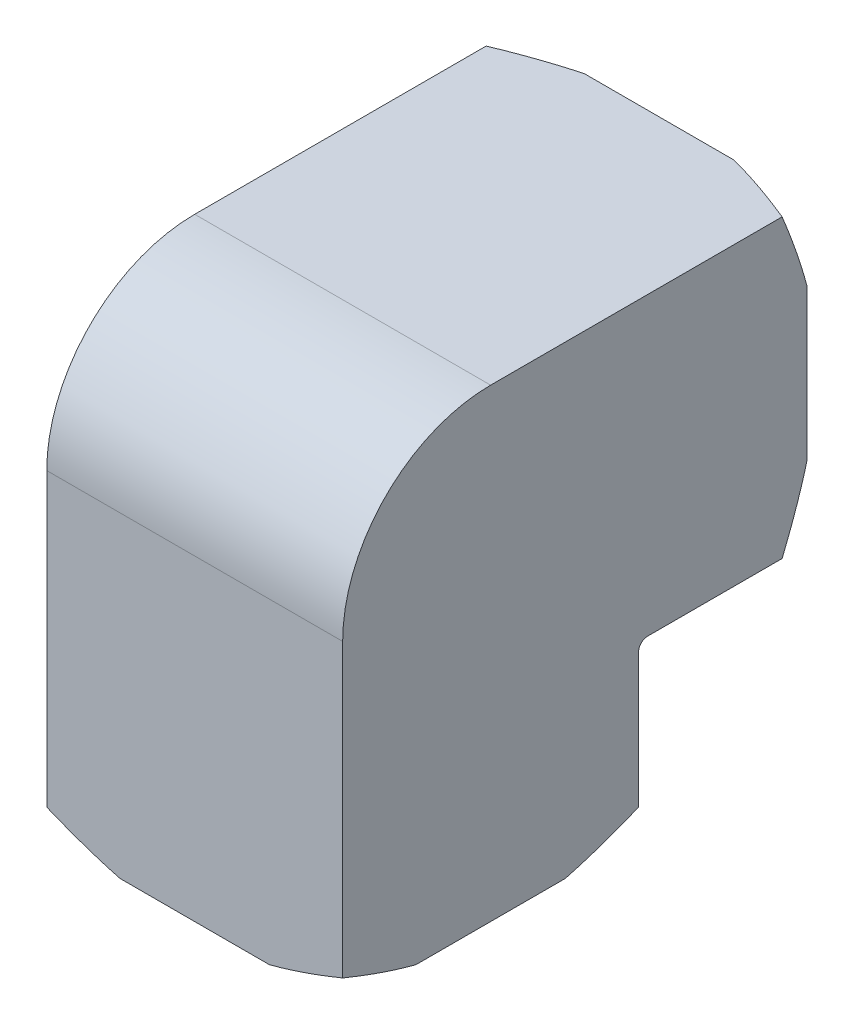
ISO-10303-21;
HEADER;
FILE_DESCRIPTION(('STEP AP214'),'2;1');
FILE_NAME('part.step','',(''),(''),'','','');
FILE_SCHEMA(('AUTOMOTIVE_DESIGN { 1 0 10303 214 1 1 1 1 }'));
ENDSEC;
DATA;
#1=APPLICATION_CONTEXT('core data for automotive mechanical design processes');
#2=APPLICATION_PROTOCOL_DEFINITION('international standard','automotive_design',2000,#1);
#3=PRODUCT_CONTEXT('',#1,'mechanical');
#4=PRODUCT('Part','Part','',(#3));
#5=PRODUCT_RELATED_PRODUCT_CATEGORY('part','',(#4));
#6=PRODUCT_DEFINITION_FORMATION('','',#4);
#7=PRODUCT_DEFINITION_CONTEXT('part definition',#1,'design');
#8=PRODUCT_DEFINITION('design','',#6,#7);
#9=PRODUCT_DEFINITION_SHAPE('','',#8);
#10=(LENGTH_UNIT() NAMED_UNIT(*) SI_UNIT(.MILLI.,.METRE.));
#11=(NAMED_UNIT(*) PLANE_ANGLE_UNIT() SI_UNIT($,.RADIAN.));
#12=(NAMED_UNIT(*) SI_UNIT($,.STERADIAN.) SOLID_ANGLE_UNIT());
#13=UNCERTAINTY_MEASURE_WITH_UNIT(LENGTH_MEASURE(1.E-05),#10,'distance_accuracy_value','');
#14=(GEOMETRIC_REPRESENTATION_CONTEXT(3) GLOBAL_UNCERTAINTY_ASSIGNED_CONTEXT((#13)) GLOBAL_UNIT_ASSIGNED_CONTEXT((#10,
#11,#12)) REPRESENTATION_CONTEXT('',''));
#15=CARTESIAN_POINT('',(0.,0.,0.));
#16=DIRECTION('',(0.,0.,1.));
#17=DIRECTION('',(1.,0.,0.));
#18=AXIS2_PLACEMENT_3D('',#15,#16,#17);
#19=CARTESIAN_POINT('',(0.,1.70527979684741E-10,0.));
#20=DIRECTION('',(0.,-1.,0.));
#21=DIRECTION('',(0.,0.,-1.));
#22=AXIS2_PLACEMENT_3D('',#19,#20,#21);
#23=CONICAL_SURFACE('',#22,8.92936999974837,1.082104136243);
#24=CARTESIAN_POINT('',(0.,0.,0.));
#25=DIRECTION('',(0.,1.,0.));
#26=DIRECTION('',(-1.,0.,0.));
#27=AXIS2_PLACEMENT_3D('',#24,#25,#26);
#28=CIRCLE('',#27,8.92937);
#29=CARTESIAN_POINT('',(8.92937000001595,9.88798645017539E-12,9.88815761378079E-12));
#30=VERTEX_POINT('',#29);
#31=CARTESIAN_POINT('',(-8.92937000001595,9.88806917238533E-12,9.88789800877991E-12));
#32=VERTEX_POINT('',#31);
#33=EDGE_CURVE('E139',#30,#32,#28,.F.);
#34=ORIENTED_EDGE('',*,*,#33,.T.);
#35=CARTESIAN_POINT('',(-8.92937000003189,1.97755915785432E-11,1.97763427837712E-11));
#36=CARTESIAN_POINT('',(-8.74389852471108,0.0986048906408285,0.0986048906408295));
#37=CARTESIAN_POINT('',(-8.55784954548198,0.196671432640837,0.196671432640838));
#38=CARTESIAN_POINT('',(-8.18437014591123,0.39150124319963,0.39150124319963));
#39=CARTESIAN_POINT('',(-7.99693961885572,0.488264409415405,0.488264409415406));
#40=CARTESIAN_POINT('',(-7.62007081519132,0.680464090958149,0.68046409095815));
#41=CARTESIAN_POINT('',(-7.43062893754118,0.77589708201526,0.775897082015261));
#42=CARTESIAN_POINT('',(-7.04989543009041,0.964895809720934,0.964895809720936));
#43=CARTESIAN_POINT('',(-6.85860384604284,1.05846159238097,1.05846159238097));
#44=CARTESIAN_POINT('',(-6.46788902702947,1.24619785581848,1.24619785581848));
#45=CARTESIAN_POINT('',(-6.26839740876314,1.34029735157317,1.34029735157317));
#46=CARTESIAN_POINT('',(-5.86668607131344,1.5255360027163,1.5255360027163));
#47=CARTESIAN_POINT('',(-5.66446645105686,1.61667526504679,1.61667526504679));
#48=CARTESIAN_POINT('',(-5.2569519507,1.7951924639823,1.7951924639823));
#49=CARTESIAN_POINT('',(-5.05165974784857,1.88257344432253,1.88257344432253));
#50=CARTESIAN_POINT('',(-4.63726797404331,2.05267906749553,2.05267906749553));
#51=CARTESIAN_POINT('',(-4.42816890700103,2.1354043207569,2.1354043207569));
#52=CARTESIAN_POINT('',(-4.00906605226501,2.29357155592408,2.29357155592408));
#53=CARTESIAN_POINT('',(-3.7991382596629,2.36911354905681,2.36911354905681));
#54=CARTESIAN_POINT('',(-3.37424111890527,2.51287732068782,2.51287732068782));
#55=CARTESIAN_POINT('',(-3.15927101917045,2.58109799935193,2.58109799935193));
#56=CARTESIAN_POINT('',(-2.72507287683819,2.70775423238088,2.70775423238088));
#57=CARTESIAN_POINT('',(-2.50587773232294,2.76624553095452,2.76624553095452));
#58=CARTESIAN_POINT('',(-2.06185362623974,2.8714115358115,2.8714115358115));
#59=CARTESIAN_POINT('',(-1.83702647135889,2.91808997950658,2.91808997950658));
#60=CARTESIAN_POINT('',(-1.42680752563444,2.98916472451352,2.98916472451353));
#61=CARTESIAN_POINT('',(-1.24231386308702,3.01613434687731,3.01613434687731));
#62=CARTESIAN_POINT('',(-0.870813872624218,3.05932672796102,3.05932672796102));
#63=CARTESIAN_POINT('',(-0.683807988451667,3.07555135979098,3.07555135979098));
#64=CARTESIAN_POINT('',(-0.308983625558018,3.09629483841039,3.09629483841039));
#65=CARTESIAN_POINT('',(-0.121168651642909,3.10084483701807,3.10084483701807));
#66=CARTESIAN_POINT('',(0.254289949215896,3.09804665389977,3.09804665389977));
#67=CARTESIAN_POINT('',(0.441933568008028,3.09069793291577,3.09069793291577));
#68=CARTESIAN_POINT('',(0.814167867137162,3.06465329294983,3.06465329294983));
#69=CARTESIAN_POINT('',(0.998770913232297,3.04604413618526,3.04604413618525));
#70=CARTESIAN_POINT('',(1.36529728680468,2.99857211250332,2.99857211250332));
#71=CARTESIAN_POINT('',(1.54722035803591,2.96970827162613,2.96970827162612));
#72=CARTESIAN_POINT('',(1.90966595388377,2.90270209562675,2.90270209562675));
#73=CARTESIAN_POINT('',(2.09015237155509,2.86446330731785,2.86446330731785));
#74=CARTESIAN_POINT('',(2.44742472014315,2.78031607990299,2.78031607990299));
#75=CARTESIAN_POINT('',(2.62421142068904,2.73440925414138,2.73440925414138));
#76=CARTESIAN_POINT('',(3.08789762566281,2.60437374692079,2.60437374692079));
#77=CARTESIAN_POINT('',(3.37172770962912,2.51478759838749,2.51478759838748));
#78=CARTESIAN_POINT('',(3.93094211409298,2.32317976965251,2.32317976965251));
#79=CARTESIAN_POINT('',(4.20631972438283,2.2211485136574,2.2211485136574));
#80=CARTESIAN_POINT('',(4.7510944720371,2.00768180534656,2.00768180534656));
#81=CARTESIAN_POINT('',(5.02046264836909,1.89620970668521,1.89620970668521));
#82=CARTESIAN_POINT('',(5.55336035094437,1.66666454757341,1.66666454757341));
#83=CARTESIAN_POINT('',(5.81689154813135,1.54859341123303,1.54859341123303));
#84=CARTESIAN_POINT('',(6.32315597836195,1.31495309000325,1.31495309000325));
#85=CARTESIAN_POINT('',(6.5661660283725,1.19968228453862,1.19968228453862));
#86=CARTESIAN_POINT('',(7.04890273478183,0.965729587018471,0.96572958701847));
#87=CARTESIAN_POINT('',(7.28862908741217,0.847047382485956,0.847047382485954));
#88=CARTESIAN_POINT('',(7.76311861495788,0.608141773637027,0.608141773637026));
#89=CARTESIAN_POINT('',(7.99790729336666,0.487943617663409,0.487943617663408));
#90=CARTESIAN_POINT('',(8.46521641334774,0.245437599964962,0.245437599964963));
#91=CARTESIAN_POINT('',(8.69773735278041,0.123130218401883,0.123130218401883));
#92=CARTESIAN_POINT('',(8.92937000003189,1.97764250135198E-11,1.97756738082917E-11));
#93=B_SPLINE_CURVE_WITH_KNOTS('',3,(#35,#36,#37,#38,#39,#40,#41,#42,#43,#44,#45,#46,#47,#48,#49,
#50,#51,#52,#53,#54,#55,#56,#57,#58,#59,#60,#61,#62,#63,#64,#65,#66,#67,#68,#69,#70,#71,#72,#73,
#74,#75,#76,#77,#78,#79,#80,#81,#82,#83,#84,#85,#86,#87,#88,#89,#90,#91,#92),.UNSPECIFIED.,.F.,
.F.,(4,2,2,2,2,2,2,2,2,2,2,2,2,2,2,2,2,2,2,2,2,2,2,2,2,2,2,2,4),(0.,0.696143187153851,
1.39234072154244,2.09012420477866,2.78789047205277,3.50726249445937,4.22660849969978,
4.94536051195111,5.66401806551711,6.37044184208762,7.07697159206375,7.77930237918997,
8.48141068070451,9.04604285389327,9.61057657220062,10.1736023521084,10.7366536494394,
11.2954208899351,11.8542412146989,12.4190717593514,12.9837836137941,13.915323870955,
14.8475854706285,15.7836480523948,16.7194391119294,17.5972392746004,18.475120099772,
19.3446851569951,20.2140548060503),.UNSPECIFIED.);
#94=EDGE_CURVE('E20',#32,#30,#93,.T.);
#95=ORIENTED_EDGE('',*,*,#94,.T.);
#96=EDGE_LOOP('',(#34,#95));
#97=FACE_BOUND('',#96,.T.);
#98=ADVANCED_FACE('F16',(#97),#23,.F.);
#99=CARTESIAN_POINT('',(0.,0.,1.70527979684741E-10));
#100=DIRECTION('',(0.,0.,-1.));
#101=DIRECTION('',(0.,1.,0.));
#102=AXIS2_PLACEMENT_3D('',#99,#100,#101);
#103=CONICAL_SURFACE('',#102,8.92936999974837,1.082104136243);
#104=CARTESIAN_POINT('',(0.,0.,0.));
#105=DIRECTION('',(0.,0.,1.));
#106=DIRECTION('',(1.,0.,0.));
#107=AXIS2_PLACEMENT_3D('',#104,#105,#106);
#108=CIRCLE('',#107,8.92937);
#109=EDGE_CURVE('E144',#32,#30,#108,.F.);
#110=ORIENTED_EDGE('',*,*,#109,.T.);
#111=ORIENTED_EDGE('',*,*,#94,.F.);
#112=EDGE_LOOP('',(#110,#111));
#113=FACE_BOUND('',#112,.T.);
#114=ADVANCED_FACE('F149',(#113),#103,.F.);
#115=CARTESIAN_POINT('',(0.,-17.926685,0.));
#116=DIRECTION('',(0.,1.,0.));
#117=DIRECTION('',(-1.,0.,0.));
#118=AXIS2_PLACEMENT_3D('',#115,#116,#117);
#119=CYLINDRICAL_SURFACE('',#118,8.92937);
#120=CARTESIAN_POINT('',(0.,-20.6801253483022,0.));
#121=DIRECTION('',(0.,-1.,0.));
#122=DIRECTION('',(0.,0.,-1.));
#123=AXIS2_PLACEMENT_3D('',#120,#121,#122);
#124=CIRCLE('',#123,8.92937000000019);
#125=CARTESIAN_POINT('',(0.,-20.6801253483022,-8.92937000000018));
#126=VERTEX_POINT('',#125);
#127=EDGE_CURVE('E148',#126,#126,#124,.T.);
#128=ORIENTED_EDGE('',*,*,#127,.T.);
#129=EDGE_LOOP('',(#128));
#130=FACE_BOUND('',#129,.T.);
#131=ORIENTED_EDGE('',*,*,#33,.F.);
#132=CARTESIAN_POINT('',(0.,0.,0.));
#133=DIRECTION('',(0.,0.707106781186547,-0.707106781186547));
#134=DIRECTION('',(0.,0.707106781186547,0.707106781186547));
#135=AXIS2_PLACEMENT_3D('',#132,#133,#134);
#136=ELLIPSE('',#135,12.6280361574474,8.92937);
#137=EDGE_CURVE('E142',#30,#32,#136,.T.);
#138=ORIENTED_EDGE('',*,*,#137,.T.);
#139=EDGE_LOOP('',(#131,#138));
#140=FACE_BOUND('',#139,.T.);
#141=ADVANCED_FACE('F140',(#130,#140),#119,.F.);
#142=CARTESIAN_POINT('',(0.,0.,-17.926685));
#143=DIRECTION('',(0.,0.,1.));
#144=DIRECTION('',(1.,0.,0.));
#145=AXIS2_PLACEMENT_3D('',#142,#143,#144);
#146=CYLINDRICAL_SURFACE('',#145,8.92937);
#147=CARTESIAN_POINT('',(0.,0.,-20.6801253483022));
#148=DIRECTION('',(0.,0.,-1.));
#149=DIRECTION('',(0.,-1.,0.));
#150=AXIS2_PLACEMENT_3D('',#147,#148,#149);
#151=CIRCLE('',#150,8.92937000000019);
#152=CARTESIAN_POINT('',(0.,-8.92937000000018,-20.6801253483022));
#153=VERTEX_POINT('',#152);
#154=EDGE_CURVE('E234',#153,#153,#151,.T.);
#155=ORIENTED_EDGE('',*,*,#154,.T.);
#156=EDGE_LOOP('',(#155));
#157=FACE_BOUND('',#156,.T.);
#158=ORIENTED_EDGE('',*,*,#109,.F.);
#159=ORIENTED_EDGE('',*,*,#137,.F.);
#160=EDGE_LOOP('',(#158,#159));
#161=FACE_BOUND('',#160,.T.);
#162=ADVANCED_FACE('F147',(#157,#161),#146,.F.);
#163=CARTESIAN_POINT('',(0.,-25.3307004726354,0.));
#164=DIRECTION('',(0.,-1.,0.));
#165=DIRECTION('',(0.,0.,-1.));
#166=AXIS2_PLACEMENT_3D('',#163,#164,#165);
#167=CONICAL_SURFACE('',#166,9.07470047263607,0.0312398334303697);
#168=ORIENTED_EDGE('',*,*,#127,.F.);
#169=EDGE_LOOP('',(#168));
#170=FACE_BOUND('',#169,.T.);
#171=CARTESIAN_POINT('',(0.,-25.3307004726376,0.));
#172=DIRECTION('',(0.,-1.,0.));
#173=DIRECTION('',(0.,0.,-1.));
#174=AXIS2_PLACEMENT_3D('',#171,#172,#173);
#175=CIRCLE('',#174,9.07470047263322);
#176=CARTESIAN_POINT('',(0.,-25.3307004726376,-9.07470047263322));
#177=VERTEX_POINT('',#176);
#178=EDGE_CURVE('E226',#177,#177,#175,.T.);
#179=ORIENTED_EDGE('',*,*,#178,.T.);
#180=EDGE_LOOP('',(#179));
#181=FACE_BOUND('',#180,.T.);
#182=ADVANCED_FACE('F250',(#170,#181),#167,.F.);
#183=CARTESIAN_POINT('',(0.,0.,-25.3307004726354));
#184=DIRECTION('',(0.,0.,-1.));
#185=DIRECTION('',(0.,1.,0.));
#186=AXIS2_PLACEMENT_3D('',#183,#184,#185);
#187=CONICAL_SURFACE('',#186,9.07470047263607,0.0312398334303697);
#188=ORIENTED_EDGE('',*,*,#154,.F.);
#189=EDGE_LOOP('',(#188));
#190=FACE_BOUND('',#189,.T.);
#191=CARTESIAN_POINT('',(0.,0.,-25.3307004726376));
#192=DIRECTION('',(0.,0.,-1.));
#193=DIRECTION('',(0.,-1.,0.));
#194=AXIS2_PLACEMENT_3D('',#191,#192,#193);
#195=CIRCLE('',#194,9.07470047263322);
#196=CARTESIAN_POINT('',(0.,-9.07470047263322,-25.3307004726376));
#197=VERTEX_POINT('',#196);
#198=EDGE_CURVE('E220',#197,#197,#195,.T.);
#199=ORIENTED_EDGE('',*,*,#198,.T.);
#200=EDGE_LOOP('',(#199));
#201=FACE_BOUND('',#200,.T.);
#202=ADVANCED_FACE('F252',(#190,#201),#187,.F.);
#203=CARTESIAN_POINT('',(0.,-27.1779999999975,0.));
#204=DIRECTION('',(0.,-1.,0.));
#205=DIRECTION('',(0.,0.,-1.));
#206=AXIS2_PLACEMENT_3D('',#203,#204,#205);
#207=CONICAL_SURFACE('',#206,10.9220000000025,0.785398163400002);
#208=CARTESIAN_POINT('',(0.,-27.1779999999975,0.));
#209=DIRECTION('',(0.,-1.,0.));
#210=DIRECTION('',(0.,0.,-1.));
#211=AXIS2_PLACEMENT_3D('',#208,#209,#210);
#212=CIRCLE('',#211,10.9220000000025);
#213=CARTESIAN_POINT('',(0.,-27.1779999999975,-10.9220000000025));
#214=VERTEX_POINT('',#213);
#215=EDGE_CURVE('E344',#214,#214,#212,.T.);
#216=ORIENTED_EDGE('',*,*,#215,.T.);
#217=EDGE_LOOP('',(#216));
#218=FACE_BOUND('',#217,.T.);
#219=ORIENTED_EDGE('',*,*,#178,.F.);
#220=EDGE_LOOP('',(#219));
#221=FACE_BOUND('',#220,.T.);
#222=ADVANCED_FACE('F259',(#218,#221),#207,.F.);
#223=CARTESIAN_POINT('',(0.,-25.0077800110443,0.));
#224=DIRECTION('',(0.,1.,0.));
#225=DIRECTION('',(-1.,0.,0.));
#226=AXIS2_PLACEMENT_3D('',#223,#224,#225);
#227=CONICAL_SURFACE('',#226,17.9829312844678,1.0471975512);
#228=CARTESIAN_POINT('',(0.,-27.177999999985,0.));
#229=DIRECTION('',(0.,1.,0.));
#230=DIRECTION('',(-1.,0.,0.));
#231=AXIS2_PLACEMENT_3D('',#228,#229,#230);
#232=CIRCLE('',#231,14.2239999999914);
#233=CARTESIAN_POINT('',(12.7,-27.1779999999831,-6.40563626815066));
#234=VERTEX_POINT('',#233);
#235=CARTESIAN_POINT('',(6.40563626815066,-27.1779999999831,-12.7));
#236=VERTEX_POINT('',#235);
#237=EDGE_CURVE('E339',#234,#236,#232,.T.);
#238=ORIENTED_EDGE('',*,*,#237,.T.);
#239=CARTESIAN_POINT('',(12.6999999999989,-25.0207236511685,-12.7));
#240=CARTESIAN_POINT('',(12.4430541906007,-25.125615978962,-12.7));
#241=CARTESIAN_POINT('',(12.185555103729,-25.2291539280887,-12.7));
#242=CARTESIAN_POINT('',(11.6693430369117,-25.4331872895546,-12.7));
#243=CARTESIAN_POINT('',(11.4106300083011,-25.533682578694,-12.7));
#244=CARTESIAN_POINT('',(10.6331224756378,-25.8298693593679,-12.7));
#245=CARTESIAN_POINT('',(10.112383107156,-26.0204987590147,-12.7));
#246=CARTESIAN_POINT('',(9.06478171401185,-26.3849455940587,-12.7));
#247=CARTESIAN_POINT('',(8.53791751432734,-26.5587568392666,-12.7));
#248=CARTESIAN_POINT('',(7.7424558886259,-26.8037032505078,-12.7));
#249=CARTESIAN_POINT('',(7.47629387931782,-26.8827626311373,-12.7));
#250=CARTESIAN_POINT('',(6.94225691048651,-27.0349716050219,-12.7));
#251=CARTESIAN_POINT('',(6.67438177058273,-27.1081205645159,-12.7));
#252=CARTESIAN_POINT('',(6.40563626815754,-27.1779999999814,-12.7));
#253=B_SPLINE_CURVE_WITH_KNOTS('',3,(#239,#240,#241,#242,#243,#244,#245,#246,#247,#248,#249,
#250,#251,#252),.UNSPECIFIED.,.F.,.F.,(4,2,2,2,2,2,4),(0.,0.832588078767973,1.66520982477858,
3.32858413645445,4.99256836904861,5.82547367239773,6.65846816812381),.UNSPECIFIED.);
#254=CARTESIAN_POINT('',(12.7,-25.0207236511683,-12.6999999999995));
#255=VERTEX_POINT('',#254);
#256=EDGE_CURVE('E335',#255,#236,#253,.T.);
#257=ORIENTED_EDGE('',*,*,#256,.F.);
#258=CARTESIAN_POINT('',(12.7,-25.0207236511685,-12.6999999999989));
#259=CARTESIAN_POINT('',(12.7,-25.125615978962,-12.4430541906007));
#260=CARTESIAN_POINT('',(12.7,-25.2291539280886,-12.185555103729));
#261=CARTESIAN_POINT('',(12.7,-25.4331872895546,-11.6693430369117));
#262=CARTESIAN_POINT('',(12.7,-25.533682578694,-11.4106300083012));
#263=CARTESIAN_POINT('',(12.7,-25.8298693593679,-10.6331224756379));
#264=CARTESIAN_POINT('',(12.7,-26.0204987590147,-10.1123831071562));
#265=CARTESIAN_POINT('',(12.7,-26.3849455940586,-9.06478171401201));
#266=CARTESIAN_POINT('',(12.7,-26.5587568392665,-8.53791751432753));
#267=CARTESIAN_POINT('',(12.7,-26.8037032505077,-7.74245588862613));
#268=CARTESIAN_POINT('',(12.7,-26.8827626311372,-7.47629387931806));
#269=CARTESIAN_POINT('',(12.7,-27.0349716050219,-6.94225691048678));
#270=CARTESIAN_POINT('',(12.7,-27.1081205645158,-6.674381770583));
#271=CARTESIAN_POINT('',(12.7,-27.1779999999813,-6.40563626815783));
#272=B_SPLINE_CURVE_WITH_KNOTS('',3,(#258,#259,#260,#261,#262,#263,#264,#265,#266,#267,#268,
#269,#270,#271),.UNSPECIFIED.,.F.,.F.,(4,2,2,2,2,2,4),(0.,0.832588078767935,1.6652098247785,
3.3285841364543,4.99256836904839,5.82547367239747,6.65846816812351),.UNSPECIFIED.);
#273=EDGE_CURVE('E347',#255,#234,#272,.T.);
#274=ORIENTED_EDGE('',*,*,#273,.T.);
#275=EDGE_LOOP('',(#238,#257,#274));
#276=FACE_BOUND('',#275,.T.);
#277=ADVANCED_FACE('F358',(#276),#227,.T.);
#278=CARTESIAN_POINT('',(0.,-13.4874,-13.4874));
#279=DIRECTION('',(1.,0.,0.));
#280=DIRECTION('',(0.,0.,-1.));
#281=AXIS2_PLACEMENT_3D('',#278,#279,#280);
#282=CYLINDRICAL_SURFACE('',#281,0.787399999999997);
#283=DIRECTION('',(1.,0.,0.));
#284=VECTOR('',#283,1.);
#285=CARTESIAN_POINT('',(0.,-12.7,-13.4874));
#286=LINE('',#285,#284);
#287=CARTESIAN_POINT('',(12.7,-12.7,-13.4874));
#288=VERTEX_POINT('',#287);
#289=CARTESIAN_POINT('',(-12.7,-12.7,-13.4874));
#290=VERTEX_POINT('',#289);
#291=EDGE_CURVE('E324',#288,#290,#286,.F.);
#292=ORIENTED_EDGE('',*,*,#291,.F.);
#293=CARTESIAN_POINT('',(12.7,-13.4874,-13.4874));
#294=DIRECTION('',(1.,0.,0.));
#295=DIRECTION('',(0.,0.,-1.));
#296=AXIS2_PLACEMENT_3D('',#293,#294,#295);
#297=CIRCLE('',#296,0.787399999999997);
#298=CARTESIAN_POINT('',(12.7,-13.4874,-12.7));
#299=VERTEX_POINT('',#298);
#300=EDGE_CURVE('E350',#288,#299,#297,.T.);
#301=ORIENTED_EDGE('',*,*,#300,.T.);
#302=DIRECTION('',(-1.,0.,0.));
#303=VECTOR('',#302,1.);
#304=CARTESIAN_POINT('',(0.,-13.4874,-12.7));
#305=LINE('',#304,#303);
#306=CARTESIAN_POINT('',(-12.7,-13.4874,-12.7));
#307=VERTEX_POINT('',#306);
#308=EDGE_CURVE('E331',#307,#299,#305,.F.);
#309=ORIENTED_EDGE('',*,*,#308,.F.);
#310=CARTESIAN_POINT('',(-12.7,-13.4874,-13.4874));
#311=DIRECTION('',(1.,0.,0.));
#312=DIRECTION('',(0.,0.,-1.));
#313=AXIS2_PLACEMENT_3D('',#310,#311,#312);
#314=CIRCLE('',#313,0.787399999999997);
#315=EDGE_CURVE('E225',#290,#307,#314,.T.);
#316=ORIENTED_EDGE('',*,*,#315,.F.);
#317=EDGE_LOOP('',(#292,#301,#309,#316));
#318=FACE_BOUND('',#317,.T.);
#319=ADVANCED_FACE('F363',(#318),#282,.F.);
#320=CARTESIAN_POINT('',(0.,0.,-25.0077800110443));
#321=DIRECTION('',(0.,0.,1.));
#322=DIRECTION('',(1.,0.,0.));
#323=AXIS2_PLACEMENT_3D('',#320,#321,#322);
#324=CONICAL_SURFACE('',#323,17.9829312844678,1.0471975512);
#325=CARTESIAN_POINT('',(0.,0.,-27.177999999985));
#326=DIRECTION('',(0.,0.,1.));
#327=DIRECTION('',(1.,0.,0.));
#328=AXIS2_PLACEMENT_3D('',#325,#326,#327);
#329=CIRCLE('',#328,14.2239999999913);
#330=CARTESIAN_POINT('',(6.40563626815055,-12.7,-27.1779999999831));
#331=VERTEX_POINT('',#330);
#332=CARTESIAN_POINT('',(12.7,-6.40563626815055,-27.1779999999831));
#333=VERTEX_POINT('',#332);
#334=EDGE_CURVE('E316',#331,#333,#329,.T.);
#335=ORIENTED_EDGE('',*,*,#334,.T.);
#336=CARTESIAN_POINT('',(12.7,-6.40563626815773,-27.1779999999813));
#337=CARTESIAN_POINT('',(12.7,-6.67438177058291,-27.1081205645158));
#338=CARTESIAN_POINT('',(12.7,-6.94225691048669,-27.0349716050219));
#339=CARTESIAN_POINT('',(12.7,-7.47629387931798,-26.8827626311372));
#340=CARTESIAN_POINT('',(12.7,-7.74245588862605,-26.8037032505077));
#341=CARTESIAN_POINT('',(12.7,-8.53791751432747,-26.5587568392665));
#342=CARTESIAN_POINT('',(12.7,-9.06478171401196,-26.3849455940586));
#343=CARTESIAN_POINT('',(12.7,-10.1123831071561,-26.0204987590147));
#344=CARTESIAN_POINT('',(12.7,-10.6331224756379,-25.8298693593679));
#345=CARTESIAN_POINT('',(12.7,-11.4106300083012,-25.533682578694));
#346=CARTESIAN_POINT('',(12.7,-11.6693430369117,-25.4331872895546));
#347=CARTESIAN_POINT('',(12.7,-12.185555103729,-25.2291539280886));
#348=CARTESIAN_POINT('',(12.7,-12.4430541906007,-25.125615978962));
#349=CARTESIAN_POINT('',(12.7,-12.6999999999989,-25.0207236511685));
#350=B_SPLINE_CURVE_WITH_KNOTS('',3,(#336,#337,#338,#339,#340,#341,#342,#343,#344,#345,#346,
#347,#348,#349),.UNSPECIFIED.,.F.,.F.,(4,2,2,2,2,2,4),(0.,0.832994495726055,1.66589979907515,
3.32988403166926,4.99325834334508,5.82588008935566,6.65846816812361),.UNSPECIFIED.);
#351=CARTESIAN_POINT('',(12.6999999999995,-12.6999999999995,-25.0207236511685));
#352=VERTEX_POINT('',#351);
#353=EDGE_CURVE('E412',#333,#352,#350,.T.);
#354=ORIENTED_EDGE('',*,*,#353,.T.);
#355=CARTESIAN_POINT('',(6.4056362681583,-12.7000000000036,-27.1779999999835));
#356=CARTESIAN_POINT('',(6.67438177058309,-12.7000000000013,-27.1081205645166));
#357=CARTESIAN_POINT('',(6.94225691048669,-12.7000000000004,-27.0349716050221));
#358=CARTESIAN_POINT('',(7.47629387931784,-12.6999999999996,-26.882762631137));
#359=CARTESIAN_POINT('',(7.74245588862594,-12.6999999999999,-26.8037032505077));
#360=CARTESIAN_POINT('',(8.53791751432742,-12.7000000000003,-26.5587568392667));
#361=CARTESIAN_POINT('',(9.06478171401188,-12.7000000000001,-26.3849455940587));
#362=CARTESIAN_POINT('',(10.112383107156,-12.6999999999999,-26.0204987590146));
#363=CARTESIAN_POINT('',(10.6331224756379,-12.7,-25.8298693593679));
#364=CARTESIAN_POINT('',(11.4106300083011,-12.7,-25.533682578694));
#365=CARTESIAN_POINT('',(11.6693430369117,-12.7,-25.4331872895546));
#366=CARTESIAN_POINT('',(12.185555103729,-12.7,-25.2291539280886));
#367=CARTESIAN_POINT('',(12.4430541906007,-12.7,-25.125615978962));
#368=CARTESIAN_POINT('',(12.6999999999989,-12.7,-25.0207236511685));
#369=B_SPLINE_CURVE_WITH_KNOTS('',3,(#355,#356,#357,#358,#359,#360,#361,#362,#363,#364,#365,
#366,#367,#368),.UNSPECIFIED.,.F.,.F.,(4,2,2,2,2,2,4),(0.,0.832994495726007,1.66589979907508,
3.3298840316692,4.99325834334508,5.82588008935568,6.65846816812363),.UNSPECIFIED.);
#370=EDGE_CURVE('E325',#331,#352,#369,.T.);
#371=ORIENTED_EDGE('',*,*,#370,.F.);
#372=EDGE_LOOP('',(#335,#354,#371));
#373=FACE_BOUND('',#372,.T.);
#374=ADVANCED_FACE('F419',(#373),#324,.T.);
#375=CARTESIAN_POINT('',(0.,0.,-27.1779999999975));
#376=DIRECTION('',(0.,0.,-1.));
#377=DIRECTION('',(-1.,0.,0.));
#378=AXIS2_PLACEMENT_3D('',#375,#376,#377);
#379=CONICAL_SURFACE('',#378,10.9220000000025,0.785398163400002);
#380=CARTESIAN_POINT('',(0.,0.,-27.1779999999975));
#381=DIRECTION('',(0.,0.,-1.));
#382=DIRECTION('',(-1.,0.,0.));
#383=AXIS2_PLACEMENT_3D('',#380,#381,#382);
#384=CIRCLE('',#383,10.9220000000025);
#385=CARTESIAN_POINT('',(-10.9220000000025,0.,-27.1779999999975));
#386=VERTEX_POINT('',#385);
#387=EDGE_CURVE('E466',#386,#386,#384,.T.);
#388=ORIENTED_EDGE('',*,*,#387,.T.);
#389=EDGE_LOOP('',(#388));
#390=FACE_BOUND('',#389,.T.);
#391=ORIENTED_EDGE('',*,*,#198,.F.);
#392=EDGE_LOOP('',(#391));
#393=FACE_BOUND('',#392,.T.);
#394=ADVANCED_FACE('F422',(#390,#393),#379,.F.);
#395=CARTESIAN_POINT('',(0.,0.,-25.0077800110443));
#396=DIRECTION('',(0.,0.,1.));
#397=DIRECTION('',(1.,0.,0.));
#398=AXIS2_PLACEMENT_3D('',#395,#396,#397);
#399=CONICAL_SURFACE('',#398,17.9829312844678,1.0471975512);
#400=CARTESIAN_POINT('',(0.,0.,-27.177999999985));
#401=DIRECTION('',(0.,0.,1.));
#402=DIRECTION('',(1.,0.,0.));
#403=AXIS2_PLACEMENT_3D('',#400,#401,#402);
#404=CIRCLE('',#403,14.2239999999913);
#405=CARTESIAN_POINT('',(12.7,6.40563626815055,-27.1779999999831));
#406=VERTEX_POINT('',#405);
#407=CARTESIAN_POINT('',(6.40563626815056,12.7,-27.1779999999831));
#408=VERTEX_POINT('',#407);
#409=EDGE_CURVE('E315',#406,#408,#404,.T.);
#410=ORIENTED_EDGE('',*,*,#409,.T.);
#411=CARTESIAN_POINT('',(12.6999999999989,12.7,-25.0207236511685));
#412=CARTESIAN_POINT('',(12.4430541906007,12.7,-25.125615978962));
#413=CARTESIAN_POINT('',(12.185555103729,12.7,-25.2291539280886));
#414=CARTESIAN_POINT('',(11.6693430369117,12.7,-25.4331872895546));
#415=CARTESIAN_POINT('',(11.4106300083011,12.7,-25.533682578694));
#416=CARTESIAN_POINT('',(10.6331224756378,12.7,-25.8298693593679));
#417=CARTESIAN_POINT('',(10.112383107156,12.7,-26.0204987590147));
#418=CARTESIAN_POINT('',(9.06478171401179,12.7,-26.3849455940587));
#419=CARTESIAN_POINT('',(8.53791751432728,12.7,-26.5587568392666));
#420=CARTESIAN_POINT('',(7.74245588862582,12.7,-26.8037032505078));
#421=CARTESIAN_POINT('',(7.47629387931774,12.7,-26.8827626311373));
#422=CARTESIAN_POINT('',(6.94225691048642,12.7,-27.0349716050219));
#423=CARTESIAN_POINT('',(6.67438177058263,12.7,-27.1081205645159));
#424=CARTESIAN_POINT('',(6.40563626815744,12.7,-27.1779999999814));
#425=B_SPLINE_CURVE_WITH_KNOTS('',3,(#411,#412,#413,#414,#415,#416,#417,#418,#419,#420,#421,
#422,#423,#424),.UNSPECIFIED.,.F.,.F.,(4,2,2,2,2,2,4),(0.,0.832588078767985,1.6652098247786,
3.3285841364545,4.99256836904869,5.82547367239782,6.65846816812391),.UNSPECIFIED.);
#426=CARTESIAN_POINT('',(12.7,12.6999999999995,-25.0207236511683));
#427=VERTEX_POINT('',#426);
#428=EDGE_CURVE('E307',#427,#408,#425,.T.);
#429=ORIENTED_EDGE('',*,*,#428,.F.);
#430=CARTESIAN_POINT('',(12.7,12.6999999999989,-25.0207236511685));
#431=CARTESIAN_POINT('',(12.7,12.4430541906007,-25.125615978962));
#432=CARTESIAN_POINT('',(12.7,12.185555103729,-25.2291539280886));
#433=CARTESIAN_POINT('',(12.7,11.6693430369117,-25.4331872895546));
#434=CARTESIAN_POINT('',(12.7,11.4106300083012,-25.533682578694));
#435=CARTESIAN_POINT('',(12.7,10.6331224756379,-25.8298693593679));
#436=CARTESIAN_POINT('',(12.7,10.1123831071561,-26.0204987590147));
#437=CARTESIAN_POINT('',(12.7,9.06478171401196,-26.3849455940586));
#438=CARTESIAN_POINT('',(12.7,8.53791751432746,-26.5587568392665));
#439=CARTESIAN_POINT('',(12.7,7.74245588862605,-26.8037032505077));
#440=CARTESIAN_POINT('',(12.7,7.47629387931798,-26.8827626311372));
#441=CARTESIAN_POINT('',(12.7,6.94225691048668,-27.0349716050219));
#442=CARTESIAN_POINT('',(12.7,6.67438177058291,-27.1081205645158));
#443=CARTESIAN_POINT('',(12.7,6.40563626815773,-27.1779999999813));
#444=B_SPLINE_CURVE_WITH_KNOTS('',3,(#430,#431,#432,#433,#434,#435,#436,#437,#438,#439,#440,
#441,#442,#443),.UNSPECIFIED.,.F.,.F.,(4,2,2,2,2,2,4),(0.,0.832588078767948,1.66520982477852,
3.32858413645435,4.99256836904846,5.82547367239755,6.65846816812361),.UNSPECIFIED.);
#445=EDGE_CURVE('E219',#427,#406,#444,.T.);
#446=ORIENTED_EDGE('',*,*,#445,.T.);
#447=EDGE_LOOP('',(#410,#429,#446));
#448=FACE_BOUND('',#447,.T.);
#449=ADVANCED_FACE('F204',(#448),#399,.T.);
#450=CARTESIAN_POINT('',(0.,-25.0077800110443,0.));
#451=DIRECTION('',(0.,1.,0.));
#452=DIRECTION('',(-1.,0.,0.));
#453=AXIS2_PLACEMENT_3D('',#450,#451,#452);
#454=CONICAL_SURFACE('',#453,17.9829312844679,1.0471975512);
#455=CARTESIAN_POINT('',(0.,-27.177999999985,0.));
#456=DIRECTION('',(0.,1.,0.));
#457=DIRECTION('',(-1.,0.,0.));
#458=AXIS2_PLACEMENT_3D('',#455,#456,#457);
#459=CIRCLE('',#458,14.2239999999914);
#460=CARTESIAN_POINT('',(6.40563626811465,-27.1779999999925,12.7));
#461=VERTEX_POINT('',#460);
#462=CARTESIAN_POINT('',(12.7,-27.1779999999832,6.40563626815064));
#463=VERTEX_POINT('',#462);
#464=EDGE_CURVE('E340',#461,#463,#459,.T.);
#465=ORIENTED_EDGE('',*,*,#464,.T.);
#466=CARTESIAN_POINT('',(12.7,-27.1779999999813,6.4056362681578));
#467=CARTESIAN_POINT('',(12.7,-27.1081205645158,6.67438177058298));
#468=CARTESIAN_POINT('',(12.7,-27.0349716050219,6.94225691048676));
#469=CARTESIAN_POINT('',(12.7,-26.8827626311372,7.47629387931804));
#470=CARTESIAN_POINT('',(12.7,-26.8037032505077,7.74245588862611));
#471=CARTESIAN_POINT('',(12.7,-26.5587568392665,8.53791751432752));
#472=CARTESIAN_POINT('',(12.7,-26.3849455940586,9.064781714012));
#473=CARTESIAN_POINT('',(12.7,-26.0204987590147,10.1123831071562));
#474=CARTESIAN_POINT('',(12.7,-25.8298693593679,10.6331224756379));
#475=CARTESIAN_POINT('',(12.7,-25.533682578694,11.4106300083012));
#476=CARTESIAN_POINT('',(12.7,-25.4331872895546,11.6693430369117));
#477=CARTESIAN_POINT('',(12.7,-25.2291539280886,12.185555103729));
#478=CARTESIAN_POINT('',(12.7,-25.125615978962,12.4430541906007));
#479=CARTESIAN_POINT('',(12.7,-25.0207236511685,12.6999999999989));
#480=B_SPLINE_CURVE_WITH_KNOTS('',3,(#466,#467,#468,#469,#470,#471,#472,#473,#474,#475,#476,
#477,#478,#479),.UNSPECIFIED.,.F.,.F.,(4,2,2,2,2,2,4),(0.,0.832994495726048,1.66589979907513,
3.32988403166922,4.99325834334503,5.82588008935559,6.65846816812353),.UNSPECIFIED.);
#481=CARTESIAN_POINT('',(12.6999999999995,-25.0207236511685,12.6999999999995));
#482=VERTEX_POINT('',#481);
#483=EDGE_CURVE('E212',#463,#482,#480,.T.);
#484=ORIENTED_EDGE('',*,*,#483,.T.);
#485=CARTESIAN_POINT('',(6.40563626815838,-27.1779999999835,12.7000000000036));
#486=CARTESIAN_POINT('',(6.67438177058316,-27.1081205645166,12.7000000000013));
#487=CARTESIAN_POINT('',(6.94225691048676,-27.0349716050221,12.7000000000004));
#488=CARTESIAN_POINT('',(7.47629387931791,-26.882762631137,12.6999999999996));
#489=CARTESIAN_POINT('',(7.74245588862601,-26.8037032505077,12.6999999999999));
#490=CARTESIAN_POINT('',(8.53791751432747,-26.5587568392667,12.7000000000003));
#491=CARTESIAN_POINT('',(9.06478171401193,-26.3849455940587,12.7000000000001));
#492=CARTESIAN_POINT('',(10.1123831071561,-26.0204987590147,12.6999999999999));
#493=CARTESIAN_POINT('',(10.6331224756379,-25.8298693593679,12.7));
#494=CARTESIAN_POINT('',(11.4106300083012,-25.533682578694,12.7));
#495=CARTESIAN_POINT('',(11.6693430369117,-25.4331872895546,12.7));
#496=CARTESIAN_POINT('',(12.185555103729,-25.2291539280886,12.7));
#497=CARTESIAN_POINT('',(12.4430541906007,-25.125615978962,12.7));
#498=CARTESIAN_POINT('',(12.6999999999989,-25.0207236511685,12.7));
#499=B_SPLINE_CURVE_WITH_KNOTS('',3,(#485,#486,#487,#488,#489,#490,#491,#492,#493,#494,#495,
#496,#497,#498),.UNSPECIFIED.,.F.,.F.,(4,2,2,2,2,2,4),(0.,0.832994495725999,1.66589979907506,
3.32988403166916,4.99325834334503,5.82588008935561,6.65846816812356),.UNSPECIFIED.);
#500=EDGE_CURVE('E188',#461,#482,#499,.T.);
#501=ORIENTED_EDGE('',*,*,#500,.F.);
#502=EDGE_LOOP('',(#465,#484,#501));
#503=FACE_BOUND('',#502,.T.);
#504=ADVANCED_FACE('F198',(#503),#454,.T.);
#505=CARTESIAN_POINT('',(12.7,38.1,0.));
#506=DIRECTION('',(-1.,0.,0.));
#507=DIRECTION('',(0.,-1.,0.));
#508=AXIS2_PLACEMENT_3D('',#505,#506,#507);
#509=PLANE('',#508);
#510=DIRECTION('',(0.,1.,0.));
#511=VECTOR('',#510,1.);
#512=CARTESIAN_POINT('',(12.7,-13.4874,-12.7));
#513=LINE('',#512,#511);
#514=EDGE_CURVE('E328',#299,#255,#513,.F.);
#515=ORIENTED_EDGE('',*,*,#514,.F.);
#516=ORIENTED_EDGE('',*,*,#300,.F.);
#517=DIRECTION('',(0.,0.,-1.));
#518=VECTOR('',#517,1.);
#519=CARTESIAN_POINT('',(12.7,-12.7,-27.3812));
#520=LINE('',#519,#518);
#521=EDGE_CURVE('E321',#352,#288,#520,.F.);
#522=ORIENTED_EDGE('',*,*,#521,.F.);
#523=ORIENTED_EDGE('',*,*,#353,.F.);
#524=DIRECTION('',(0.,-1.,0.));
#525=VECTOR('',#524,1.);
#526=CARTESIAN_POINT('',(12.7,-37.211,-27.178));
#527=LINE('',#526,#525);
#528=EDGE_CURVE('E312',#333,#406,#527,.F.);
#529=ORIENTED_EDGE('',*,*,#528,.T.);
#530=ORIENTED_EDGE('',*,*,#445,.F.);
#531=DIRECTION('',(0.,0.,1.));
#532=VECTOR('',#531,1.);
#533=CARTESIAN_POINT('',(12.7,12.7,0.));
#534=LINE('',#533,#532);
#535=CARTESIAN_POINT('',(12.7,12.7,0.));
#536=VERTEX_POINT('',#535);
#537=EDGE_CURVE('E308',#536,#427,#534,.F.);
#538=ORIENTED_EDGE('',*,*,#537,.F.);
#539=CARTESIAN_POINT('',(12.7,0.,0.));
#540=DIRECTION('',(1.,0.,0.));
#541=DIRECTION('',(0.,0.,-1.));
#542=AXIS2_PLACEMENT_3D('',#539,#540,#541);
#543=CIRCLE('',#542,12.7);
#544=CARTESIAN_POINT('',(12.7,0.,12.7));
#545=VERTEX_POINT('',#544);
#546=EDGE_CURVE('E196',#545,#536,#543,.F.);
#547=ORIENTED_EDGE('',*,*,#546,.F.);
#548=DIRECTION('',(0.,-1.,0.));
#549=VECTOR('',#548,1.);
#550=CARTESIAN_POINT('',(12.7,-27.3812,12.7));
#551=LINE('',#550,#549);
#552=EDGE_CURVE('E194',#482,#545,#551,.F.);
#553=ORIENTED_EDGE('',*,*,#552,.F.);
#554=ORIENTED_EDGE('',*,*,#483,.F.);
#555=DIRECTION('',(0.,0.,1.));
#556=VECTOR('',#555,1.);
#557=CARTESIAN_POINT('',(12.7,-27.178,-37.211));
#558=LINE('',#557,#556);
#559=EDGE_CURVE('E337',#463,#234,#558,.F.);
#560=ORIENTED_EDGE('',*,*,#559,.T.);
#561=ORIENTED_EDGE('',*,*,#273,.F.);
#562=EDGE_LOOP('',(#515,#516,#522,#523,#529,#530,#538,#547,#553,#554,#560,#561));
#563=FACE_BOUND('',#562,.T.);
#564=ADVANCED_FACE('F203',(#563),#509,.F.);
#565=CARTESIAN_POINT('',(0.,-27.178,-37.211));
#566=DIRECTION('',(0.,1.,0.));
#567=DIRECTION('',(0.,0.,1.));
#568=AXIS2_PLACEMENT_3D('',#565,#566,#567);
#569=PLANE('',#568);
#570=ORIENTED_EDGE('',*,*,#215,.F.);
#571=EDGE_LOOP('',(#570));
#572=FACE_BOUND('',#571,.T.);
#573=ORIENTED_EDGE('',*,*,#559,.F.);
#574=ORIENTED_EDGE('',*,*,#464,.F.);
#575=DIRECTION('',(1.,0.,0.));
#576=VECTOR('',#575,1.);
#577=CARTESIAN_POINT('',(0.,-27.178,12.7));
#578=LINE('',#577,#576);
#579=CARTESIAN_POINT('',(-6.40563626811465,-27.1779999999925,12.7));
#580=VERTEX_POINT('',#579);
#581=EDGE_CURVE('E187',#580,#461,#578,.T.);
#582=ORIENTED_EDGE('',*,*,#581,.F.);
#583=CARTESIAN_POINT('',(0.,-27.177999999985,0.));
#584=DIRECTION('',(0.,1.,0.));
#585=DIRECTION('',(-1.,0.,0.));
#586=AXIS2_PLACEMENT_3D('',#583,#584,#585);
#587=CIRCLE('',#586,14.2239999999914);
#588=CARTESIAN_POINT('',(-12.7,-27.1779999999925,6.40563626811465));
#589=VERTEX_POINT('',#588);
#590=EDGE_CURVE('E179',#589,#580,#587,.T.);
#591=ORIENTED_EDGE('',*,*,#590,.F.);
#592=DIRECTION('',(0.,0.,1.));
#593=VECTOR('',#592,1.);
#594=CARTESIAN_POINT('',(-12.7,-27.178,0.));
#595=LINE('',#594,#593);
#596=CARTESIAN_POINT('',(-12.7,-27.1779999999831,-6.40563626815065));
#597=VERTEX_POINT('',#596);
#598=EDGE_CURVE('E178',#589,#597,#595,.F.);
#599=ORIENTED_EDGE('',*,*,#598,.T.);
#600=CARTESIAN_POINT('',(0.,-27.177999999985,0.));
#601=DIRECTION('',(0.,1.,0.));
#602=DIRECTION('',(-1.,0.,0.));
#603=AXIS2_PLACEMENT_3D('',#600,#601,#602);
#604=CIRCLE('',#603,14.2239999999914);
#605=CARTESIAN_POINT('',(-6.40563626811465,-27.1779999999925,-12.7));
#606=VERTEX_POINT('',#605);
#607=EDGE_CURVE('E374',#606,#597,#604,.T.);
#608=ORIENTED_EDGE('',*,*,#607,.F.);
#609=DIRECTION('',(-1.,0.,0.));
#610=VECTOR('',#609,1.);
#611=CARTESIAN_POINT('',(0.,-27.178,-12.7));
#612=LINE('',#611,#610);
#613=EDGE_CURVE('E332',#236,#606,#612,.T.);
#614=ORIENTED_EDGE('',*,*,#613,.F.);
#615=ORIENTED_EDGE('',*,*,#237,.F.);
#616=EDGE_LOOP('',(#573,#574,#582,#591,#599,#608,#614,#615));
#617=FACE_BOUND('',#616,.T.);
#618=ADVANCED_FACE('F391',(#572,#617),#569,.F.);
#619=CARTESIAN_POINT('',(0.,-25.0077800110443,0.));
#620=DIRECTION('',(0.,1.,0.));
#621=DIRECTION('',(-1.,0.,0.));
#622=AXIS2_PLACEMENT_3D('',#619,#620,#621);
#623=CONICAL_SURFACE('',#622,17.9829312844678,1.0471975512);
#624=ORIENTED_EDGE('',*,*,#607,.T.);
#625=CARTESIAN_POINT('',(-12.7,-27.1779999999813,-6.40563626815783));
#626=CARTESIAN_POINT('',(-12.7,-27.1081205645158,-6.67438177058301));
#627=CARTESIAN_POINT('',(-12.7,-27.0349716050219,-6.94225691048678));
#628=CARTESIAN_POINT('',(-12.7,-26.8827626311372,-7.47629387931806));
#629=CARTESIAN_POINT('',(-12.7,-26.8037032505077,-7.74245588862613));
#630=CARTESIAN_POINT('',(-12.7,-26.5587568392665,-8.53791751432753));
#631=CARTESIAN_POINT('',(-12.7,-26.3849455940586,-9.06478171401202));
#632=CARTESIAN_POINT('',(-12.7,-26.0204987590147,-10.1123831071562));
#633=CARTESIAN_POINT('',(-12.7,-25.8298693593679,-10.6331224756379));
#634=CARTESIAN_POINT('',(-12.7,-25.533682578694,-11.4106300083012));
#635=CARTESIAN_POINT('',(-12.7,-25.4331872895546,-11.6693430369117));
#636=CARTESIAN_POINT('',(-12.7,-25.2291539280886,-12.185555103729));
#637=CARTESIAN_POINT('',(-12.7,-25.125615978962,-12.4430541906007));
#638=CARTESIAN_POINT('',(-12.7,-25.0207236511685,-12.6999999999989));
#639=B_SPLINE_CURVE_WITH_KNOTS('',3,(#625,#626,#627,#628,#629,#630,#631,#632,#633,#634,#635,
#636,#637,#638),.UNSPECIFIED.,.F.,.F.,(4,2,2,2,2,2,4),(0.,0.83299449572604,1.66589979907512,
3.32988403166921,4.993258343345,5.82588008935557,6.6584681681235),.UNSPECIFIED.);
#640=CARTESIAN_POINT('',(-12.6999999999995,-25.0207236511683,-12.7));
#641=VERTEX_POINT('',#640);
#642=EDGE_CURVE('E180',#597,#641,#639,.T.);
#643=ORIENTED_EDGE('',*,*,#642,.T.);
#644=CARTESIAN_POINT('',(-6.4056362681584,-27.1779999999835,-12.7000000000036));
#645=CARTESIAN_POINT('',(-6.67438177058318,-27.1081205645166,-12.7000000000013));
#646=CARTESIAN_POINT('',(-6.94225691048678,-27.0349716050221,-12.7000000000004));
#647=CARTESIAN_POINT('',(-7.47629387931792,-26.882762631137,-12.6999999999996));
#648=CARTESIAN_POINT('',(-7.74245588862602,-26.8037032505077,-12.6999999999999));
#649=CARTESIAN_POINT('',(-8.53791751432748,-26.5587568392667,-12.7000000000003));
#650=CARTESIAN_POINT('',(-9.06478171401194,-26.3849455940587,-12.7000000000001));
#651=CARTESIAN_POINT('',(-10.1123831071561,-26.0204987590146,-12.6999999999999));
#652=CARTESIAN_POINT('',(-10.6331224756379,-25.8298693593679,-12.7));
#653=CARTESIAN_POINT('',(-11.4106300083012,-25.533682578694,-12.7));
#654=CARTESIAN_POINT('',(-11.6693430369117,-25.4331872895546,-12.7));
#655=CARTESIAN_POINT('',(-12.185555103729,-25.2291539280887,-12.7));
#656=CARTESIAN_POINT('',(-12.4430541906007,-25.125615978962,-12.7));
#657=CARTESIAN_POINT('',(-12.6999999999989,-25.0207236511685,-12.7));
#658=B_SPLINE_CURVE_WITH_KNOTS('',3,(#644,#645,#646,#647,#648,#649,#650,#651,#652,#653,#654,
#655,#656,#657),.UNSPECIFIED.,.F.,.F.,(4,2,2,2,2,2,4),(0.,0.832994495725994,1.66589979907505,
3.32988403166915,4.99325834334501,5.82588008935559,6.65846816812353),.UNSPECIFIED.);
#659=EDGE_CURVE('E334',#606,#641,#658,.T.);
#660=ORIENTED_EDGE('',*,*,#659,.F.);
#661=EDGE_LOOP('',(#624,#643,#660));
#662=FACE_BOUND('',#661,.T.);
#663=ADVANCED_FACE('F384',(#662),#623,.T.);
#664=CARTESIAN_POINT('',(0.,-13.4874,-12.7));
#665=DIRECTION('',(0.,0.,-1.));
#666=DIRECTION('',(-1.,0.,0.));
#667=AXIS2_PLACEMENT_3D('',#664,#665,#666);
#668=PLANE('',#667);
#669=ORIENTED_EDGE('',*,*,#308,.T.);
#670=ORIENTED_EDGE('',*,*,#514,.T.);
#671=ORIENTED_EDGE('',*,*,#256,.T.);
#672=ORIENTED_EDGE('',*,*,#613,.T.);
#673=ORIENTED_EDGE('',*,*,#659,.T.);
#674=DIRECTION('',(0.,1.,0.));
#675=VECTOR('',#674,1.);
#676=CARTESIAN_POINT('',(-12.7,-50.8,-12.7));
#677=LINE('',#676,#675);
#678=EDGE_CURVE('E294',#641,#307,#677,.T.);
#679=ORIENTED_EDGE('',*,*,#678,.T.);
#680=EDGE_LOOP('',(#669,#670,#671,#672,#673,#679));
#681=FACE_BOUND('',#680,.T.);
#682=ADVANCED_FACE('F379',(#681),#668,.T.);
#683=CARTESIAN_POINT('',(0.,-12.7,-27.3812));
#684=DIRECTION('',(0.,-1.,0.));
#685=DIRECTION('',(0.,0.,-1.));
#686=AXIS2_PLACEMENT_3D('',#683,#684,#685);
#687=PLANE('',#686);
#688=ORIENTED_EDGE('',*,*,#291,.T.);
#689=DIRECTION('',(0.,0.,1.));
#690=VECTOR('',#689,1.);
#691=CARTESIAN_POINT('',(-12.7,-12.7,0.));
#692=LINE('',#691,#690);
#693=CARTESIAN_POINT('',(-12.699999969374,-12.6999999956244,-25.0207236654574));
#694=VERTEX_POINT('',#693);
#695=EDGE_CURVE('E291',#290,#694,#692,.F.);
#696=ORIENTED_EDGE('',*,*,#695,.T.);
#697=CARTESIAN_POINT('',(-6.40563626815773,-12.7,-27.1779999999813));
#698=CARTESIAN_POINT('',(-6.674381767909,-12.7,-27.1081205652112));
#699=CARTESIAN_POINT('',(-6.94225690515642,-12.7,-27.0349716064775));
#700=CARTESIAN_POINT('',(-7.47629386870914,-12.7,-26.8827626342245));
#701=CARTESIAN_POINT('',(-7.74245587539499,-12.7,-26.8037032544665));
#702=CARTESIAN_POINT('',(-8.53791749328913,-12.7,-26.5587568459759));
#703=CARTESIAN_POINT('',(-9.06478168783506,-12.7,-26.3849456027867));
#704=CARTESIAN_POINT('',(-10.1123830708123,-12.7,-26.0204987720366));
#705=CARTESIAN_POINT('',(-10.6331224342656,-12.7,-25.8298693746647));
#706=CARTESIAN_POINT('',(-11.4106299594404,-12.7,-25.5336825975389));
#707=CARTESIAN_POINT('',(-11.6693429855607,-12.7,-25.4331873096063));
#708=CARTESIAN_POINT('',(-12.1855550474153,-12.7,-25.2291539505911));
#709=CARTESIAN_POINT('',(-12.4430541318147,-12.7,-25.1256160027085));
#710=CARTESIAN_POINT('',(-12.699999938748,-12.7,-25.0207236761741));
#711=B_SPLINE_CURVE_WITH_KNOTS('',3,(#697,#698,#699,#700,#701,#702,#703,#704,#705,#706,#707,
#708,#709,#710),.UNSPECIFIED.,.F.,.F.,(4,2,2,2,2,2,4),(0.,0.83299448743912,1.66589978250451,
3.32988399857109,4.99325829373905,5.82588003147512,6.65846810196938),.UNSPECIFIED.);
#712=CARTESIAN_POINT('',(-6.40563626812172,-12.7,-27.1779999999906));
#713=VERTEX_POINT('',#712);
#714=EDGE_CURVE('E320',#713,#694,#711,.T.);
#715=ORIENTED_EDGE('',*,*,#714,.F.);
#716=DIRECTION('',(1.,0.,0.));
#717=VECTOR('',#716,1.);
#718=CARTESIAN_POINT('',(0.,-12.7,-27.178));
#719=LINE('',#718,#717);
#720=EDGE_CURVE('E317',#713,#331,#719,.T.);
#721=ORIENTED_EDGE('',*,*,#720,.T.);
#722=ORIENTED_EDGE('',*,*,#370,.T.);
#723=ORIENTED_EDGE('',*,*,#521,.T.);
#724=EDGE_LOOP('',(#688,#696,#715,#721,#722,#723));
#725=FACE_BOUND('',#724,.T.);
#726=ADVANCED_FACE('F383',(#725),#687,.T.);
#727=CARTESIAN_POINT('',(0.,0.,-25.0077800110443));
#728=DIRECTION('',(0.,0.,1.));
#729=DIRECTION('',(1.,0.,0.));
#730=AXIS2_PLACEMENT_3D('',#727,#728,#729);
#731=CONICAL_SURFACE('',#730,17.9829312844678,1.0471975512);
#732=CARTESIAN_POINT('',(-12.6999999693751,-12.6999999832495,-25.0207236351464));
#733=CARTESIAN_POINT('',(-12.6999999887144,-12.4430541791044,-25.1256159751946));
#734=CARTESIAN_POINT('',(-12.6999999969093,-12.1855550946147,-25.2291539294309));
#735=CARTESIAN_POINT('',(-12.7000000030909,-11.6693430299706,-25.4331872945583));
#736=CARTESIAN_POINT('',(-12.7000000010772,-11.4106300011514,-25.5336825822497));
#737=CARTESIAN_POINT('',(-12.699999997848,-10.6331224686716,-25.8298693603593));
#738=CARTESIAN_POINT('',(-12.6999999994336,-10.1123831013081,-26.0204987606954));
#739=CARTESIAN_POINT('',(-12.7000000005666,-9.06478171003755,-26.384945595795));
#740=CARTESIAN_POINT('',(-12.7000000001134,-8.5379175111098,-26.5587568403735));
#741=CARTESIAN_POINT('',(-12.6999999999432,-7.7424558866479,-26.8037032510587));
#742=CARTESIAN_POINT('',(-12.6999999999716,-7.47629387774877,-26.8827626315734));
#743=CARTESIAN_POINT('',(-12.7000000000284,-6.94225690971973,-27.0349716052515));
#744=CARTESIAN_POINT('',(-12.7000000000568,-6.67438177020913,-27.1081205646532));
#745=CARTESIAN_POINT('',(-12.7,-6.40563626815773,-27.1779999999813));
#746=B_SPLINE_CURVE_WITH_KNOTS('',3,(#732,#733,#734,#735,#736,#737,#738,#739,#740,#741,#742,
#743,#744,#745),.UNSPECIFIED.,.F.,.F.,(4,2,2,2,2,2,4),(0.,0.832588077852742,1.66520982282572,
3.32858413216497,4.99256836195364,5.82547366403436,6.65846815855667),.UNSPECIFIED.);
#747=CARTESIAN_POINT('',(-12.7,-6.40563626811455,-27.1779999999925));
#748=VERTEX_POINT('',#747);
#749=EDGE_CURVE('E290',#694,#748,#746,.T.);
#750=ORIENTED_EDGE('',*,*,#749,.T.);
#751=CARTESIAN_POINT('',(0.,0.,-27.177999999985));
#752=DIRECTION('',(0.,0.,1.));
#753=DIRECTION('',(1.,0.,0.));
#754=AXIS2_PLACEMENT_3D('',#751,#752,#753);
#755=CIRCLE('',#754,14.2239999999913);
#756=EDGE_CURVE('E469',#748,#713,#755,.T.);
#757=ORIENTED_EDGE('',*,*,#756,.T.);
#758=ORIENTED_EDGE('',*,*,#714,.T.);
#759=EDGE_LOOP('',(#750,#757,#758));
#760=FACE_BOUND('',#759,.T.);
#761=ADVANCED_FACE('F433',(#760),#731,.T.);
#762=CARTESIAN_POINT('',(0.,-37.211,-27.178));
#763=DIRECTION('',(0.,0.,1.));
#764=DIRECTION('',(0.,-1.,0.));
#765=AXIS2_PLACEMENT_3D('',#762,#763,#764);
#766=PLANE('',#765);
#767=ORIENTED_EDGE('',*,*,#387,.F.);
#768=EDGE_LOOP('',(#767));
#769=FACE_BOUND('',#768,.T.);
#770=DIRECTION('',(0.,1.,0.));
#771=VECTOR('',#770,1.);
#772=CARTESIAN_POINT('',(-12.7,-50.8,-27.178));
#773=LINE('',#772,#771);
#774=CARTESIAN_POINT('',(-12.7,6.40563626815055,-27.1779999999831));
#775=VERTEX_POINT('',#774);
#776=EDGE_CURVE('E286',#748,#775,#773,.T.);
#777=ORIENTED_EDGE('',*,*,#776,.T.);
#778=CARTESIAN_POINT('',(0.,0.,-27.177999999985));
#779=DIRECTION('',(0.,0.,1.));
#780=DIRECTION('',(1.,0.,0.));
#781=AXIS2_PLACEMENT_3D('',#778,#779,#780);
#782=CIRCLE('',#781,14.2239999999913);
#783=CARTESIAN_POINT('',(-6.40563626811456,12.7,-27.1779999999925));
#784=VERTEX_POINT('',#783);
#785=EDGE_CURVE('E461',#784,#775,#782,.T.);
#786=ORIENTED_EDGE('',*,*,#785,.F.);
#787=DIRECTION('',(1.,0.,0.));
#788=VECTOR('',#787,1.);
#789=CARTESIAN_POINT('',(0.,12.7,-27.178));
#790=LINE('',#789,#788);
#791=EDGE_CURVE('E304',#408,#784,#790,.F.);
#792=ORIENTED_EDGE('',*,*,#791,.F.);
#793=ORIENTED_EDGE('',*,*,#409,.F.);
#794=ORIENTED_EDGE('',*,*,#528,.F.);
#795=ORIENTED_EDGE('',*,*,#334,.F.);
#796=ORIENTED_EDGE('',*,*,#720,.F.);
#797=ORIENTED_EDGE('',*,*,#756,.F.);
#798=EDGE_LOOP('',(#777,#786,#792,#793,#794,#795,#796,#797));
#799=FACE_BOUND('',#798,.T.);
#800=ADVANCED_FACE('F437',(#769,#799),#766,.F.);
#801=CARTESIAN_POINT('',(0.,0.,-25.0077800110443));
#802=DIRECTION('',(0.,0.,1.));
#803=DIRECTION('',(1.,0.,0.));
#804=AXIS2_PLACEMENT_3D('',#801,#802,#803);
#805=CONICAL_SURFACE('',#804,17.9829312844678,1.0471975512);
#806=ORIENTED_EDGE('',*,*,#785,.T.);
#807=CARTESIAN_POINT('',(-12.7,6.40563626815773,-27.1779999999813));
#808=CARTESIAN_POINT('',(-12.7,6.67438177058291,-27.1081205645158));
#809=CARTESIAN_POINT('',(-12.7,6.94225691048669,-27.0349716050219));
#810=CARTESIAN_POINT('',(-12.7,7.47629387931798,-26.8827626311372));
#811=CARTESIAN_POINT('',(-12.7,7.74245588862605,-26.8037032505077));
#812=CARTESIAN_POINT('',(-12.7,8.53791751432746,-26.5587568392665));
#813=CARTESIAN_POINT('',(-12.7,9.06478171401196,-26.3849455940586));
#814=CARTESIAN_POINT('',(-12.7,10.1123831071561,-26.0204987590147));
#815=CARTESIAN_POINT('',(-12.7,10.6331224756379,-25.8298693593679));
#816=CARTESIAN_POINT('',(-12.7,11.4106300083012,-25.533682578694));
#817=CARTESIAN_POINT('',(-12.7,11.6693430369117,-25.4331872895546));
#818=CARTESIAN_POINT('',(-12.7,12.185555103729,-25.2291539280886));
#819=CARTESIAN_POINT('',(-12.7,12.4430541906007,-25.125615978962));
#820=CARTESIAN_POINT('',(-12.7,12.6999999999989,-25.0207236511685));
#821=B_SPLINE_CURVE_WITH_KNOTS('',3,(#807,#808,#809,#810,#811,#812,#813,#814,#815,#816,#817,
#818,#819,#820),.UNSPECIFIED.,.F.,.F.,(4,2,2,2,2,2,4),(0.,0.832994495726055,1.66589979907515,
3.32988403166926,4.99325834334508,5.82588008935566,6.65846816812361),.UNSPECIFIED.);
#822=CARTESIAN_POINT('',(-12.6999999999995,12.7,-25.0207236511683));
#823=VERTEX_POINT('',#822);
#824=EDGE_CURVE('E282',#775,#823,#821,.T.);
#825=ORIENTED_EDGE('',*,*,#824,.T.);
#826=CARTESIAN_POINT('',(-6.4056362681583,12.7000000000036,-27.1779999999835));
#827=CARTESIAN_POINT('',(-6.67438177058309,12.7000000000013,-27.1081205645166));
#828=CARTESIAN_POINT('',(-6.94225691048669,12.7000000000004,-27.0349716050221));
#829=CARTESIAN_POINT('',(-7.47629387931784,12.6999999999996,-26.882762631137));
#830=CARTESIAN_POINT('',(-7.74245588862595,12.6999999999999,-26.8037032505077));
#831=CARTESIAN_POINT('',(-8.53791751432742,12.7000000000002,-26.5587568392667));
#832=CARTESIAN_POINT('',(-9.06478171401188,12.7000000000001,-26.3849455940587));
#833=CARTESIAN_POINT('',(-10.1123831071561,12.6999999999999,-26.0204987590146));
#834=CARTESIAN_POINT('',(-10.6331224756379,12.7,-25.8298693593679));
#835=CARTESIAN_POINT('',(-11.4106300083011,12.7,-25.533682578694));
#836=CARTESIAN_POINT('',(-11.6693430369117,12.7,-25.4331872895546));
#837=CARTESIAN_POINT('',(-12.185555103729,12.7,-25.2291539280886));
#838=CARTESIAN_POINT('',(-12.4430541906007,12.7,-25.125615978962));
#839=CARTESIAN_POINT('',(-12.6999999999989,12.7,-25.0207236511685));
#840=B_SPLINE_CURVE_WITH_KNOTS('',3,(#826,#827,#828,#829,#830,#831,#832,#833,#834,#835,#836,
#837,#838,#839),.UNSPECIFIED.,.F.,.F.,(4,2,2,2,2,2,4),(0.,0.832994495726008,1.66589979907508,
3.3298840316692,4.99325834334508,5.82588008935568,6.65846816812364),.UNSPECIFIED.);
#841=EDGE_CURVE('E311',#784,#823,#840,.T.);
#842=ORIENTED_EDGE('',*,*,#841,.F.);
#843=EDGE_LOOP('',(#806,#825,#842));
#844=FACE_BOUND('',#843,.T.);
#845=ADVANCED_FACE('F448',(#844),#805,.T.);
#846=CARTESIAN_POINT('',(0.,12.7,0.));
#847=DIRECTION('',(0.,1.,0.));
#848=DIRECTION('',(0.,0.,1.));
#849=AXIS2_PLACEMENT_3D('',#846,#847,#848);
#850=PLANE('',#849);
#851=ORIENTED_EDGE('',*,*,#428,.T.);
#852=ORIENTED_EDGE('',*,*,#791,.T.);
#853=ORIENTED_EDGE('',*,*,#841,.T.);
#854=DIRECTION('',(0.,0.,1.));
#855=VECTOR('',#854,1.);
#856=CARTESIAN_POINT('',(-12.7,12.7,0.));
#857=LINE('',#856,#855);
#858=CARTESIAN_POINT('',(-12.7,12.7,0.));
#859=VERTEX_POINT('',#858);
#860=EDGE_CURVE('E281',#823,#859,#857,.T.);
#861=ORIENTED_EDGE('',*,*,#860,.T.);
#862=DIRECTION('',(1.,0.,0.));
#863=VECTOR('',#862,1.);
#864=CARTESIAN_POINT('',(0.,12.7,0.));
#865=LINE('',#864,#863);
#866=EDGE_CURVE('E195',#536,#859,#865,.F.);
#867=ORIENTED_EDGE('',*,*,#866,.F.);
#868=ORIENTED_EDGE('',*,*,#537,.T.);
#869=EDGE_LOOP('',(#851,#852,#853,#861,#867,#868));
#870=FACE_BOUND('',#869,.T.);
#871=ADVANCED_FACE('F452',(#870),#850,.T.);
#872=CARTESIAN_POINT('',(0.,0.,0.));
#873=DIRECTION('',(1.,0.,0.));
#874=DIRECTION('',(0.,0.,-1.));
#875=AXIS2_PLACEMENT_3D('',#872,#873,#874);
#876=CYLINDRICAL_SURFACE('',#875,12.7);
#877=ORIENTED_EDGE('',*,*,#546,.T.);
#878=ORIENTED_EDGE('',*,*,#866,.T.);
#879=CARTESIAN_POINT('',(-12.7,0.,0.));
#880=DIRECTION('',(1.,0.,0.));
#881=DIRECTION('',(0.,0.,-1.));
#882=AXIS2_PLACEMENT_3D('',#879,#880,#881);
#883=CIRCLE('',#882,12.7);
#884=CARTESIAN_POINT('',(-12.7,0.,12.7));
#885=VERTEX_POINT('',#884);
#886=EDGE_CURVE('E160',#859,#885,#883,.T.);
#887=ORIENTED_EDGE('',*,*,#886,.T.);
#888=DIRECTION('',(1.,0.,0.));
#889=VECTOR('',#888,1.);
#890=CARTESIAN_POINT('',(0.,0.,12.7));
#891=LINE('',#890,#889);
#892=EDGE_CURVE('E279',#545,#885,#891,.F.);
#893=ORIENTED_EDGE('',*,*,#892,.F.);
#894=EDGE_LOOP('',(#877,#878,#887,#893));
#895=FACE_BOUND('',#894,.T.);
#896=ADVANCED_FACE('F278',(#895),#876,.T.);
#897=CARTESIAN_POINT('',(0.,-27.3812,12.7));
#898=DIRECTION('',(0.,0.,1.));
#899=DIRECTION('',(0.,-1.,0.));
#900=AXIS2_PLACEMENT_3D('',#897,#898,#899);
#901=PLANE('',#900);
#902=CARTESIAN_POINT('',(-6.40563626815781,-27.1779999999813,12.7));
#903=CARTESIAN_POINT('',(-6.674381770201,-27.1081205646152,12.7));
#904=CARTESIAN_POINT('',(-6.94225690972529,-27.0349716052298,12.7));
#905=CARTESIAN_POINT('',(-7.4762938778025,-26.8827626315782,12.7));
#906=CARTESIAN_POINT('',(-7.74245588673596,-26.8037032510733,12.7));
#907=CARTESIAN_POINT('',(-8.53791751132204,-26.558756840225,12.7));
#908=CARTESIAN_POINT('',(-9.06478171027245,-26.3849455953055,12.7));
#909=CARTESIAN_POINT('',(-10.1123831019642,-26.0204987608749,12.7));
#910=CARTESIAN_POINT('',(-10.6331224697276,-25.8298693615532,12.7));
#911=CARTESIAN_POINT('',(-11.4106300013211,-25.5336825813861,12.7));
#912=CARTESIAN_POINT('',(-11.6693430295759,-25.4331872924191,12.7));
#913=CARTESIAN_POINT('',(-12.1855550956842,-25.2291539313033,12.7));
#914=CARTESIAN_POINT('',(-12.4430541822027,-25.1256159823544,12.7));
#915=CARTESIAN_POINT('',(-12.6999999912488,-25.0207236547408,12.7));
#916=B_SPLINE_CURVE_WITH_KNOTS('',3,(#902,#903,#904,#905,#906,#907,#908,#909,#910,#911,#912,
#913,#914,#915),.UNSPECIFIED.,.F.,.F.,(4,2,2,2,2,2,4),(0.,0.832994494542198,1.6658997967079,
3.32988402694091,4.99325833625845,5.82588008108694,6.65846815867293),.UNSPECIFIED.);
#917=CARTESIAN_POINT('',(-12.6999999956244,-25.0207236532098,12.6999999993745));
#918=VERTEX_POINT('',#917);
#919=EDGE_CURVE('E37',#580,#918,#916,.T.);
#920=ORIENTED_EDGE('',*,*,#919,.F.);
#921=ORIENTED_EDGE('',*,*,#581,.T.);
#922=ORIENTED_EDGE('',*,*,#500,.T.);
#923=ORIENTED_EDGE('',*,*,#552,.T.);
#924=ORIENTED_EDGE('',*,*,#892,.T.);
#925=DIRECTION('',(0.,1.,0.));
#926=VECTOR('',#925,1.);
#927=CARTESIAN_POINT('',(-12.7,-50.8,12.7));
#928=LINE('',#927,#926);
#929=EDGE_CURVE('E29',#885,#918,#928,.F.);
#930=ORIENTED_EDGE('',*,*,#929,.T.);
#931=EDGE_LOOP('',(#920,#921,#922,#923,#924,#930));
#932=FACE_BOUND('',#931,.T.);
#933=ADVANCED_FACE('F168',(#932),#901,.T.);
#934=CARTESIAN_POINT('',(0.,-25.0077800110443,0.));
#935=DIRECTION('',(0.,1.,0.));
#936=DIRECTION('',(-1.,0.,0.));
#937=AXIS2_PLACEMENT_3D('',#934,#935,#936);
#938=CONICAL_SURFACE('',#937,17.9829312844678,1.0471975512);
#939=ORIENTED_EDGE('',*,*,#590,.T.);
#940=ORIENTED_EDGE('',*,*,#919,.T.);
#941=CARTESIAN_POINT('',(-12.6999999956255,-25.02072364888,12.6999999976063));
#942=CARTESIAN_POINT('',(-12.699999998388,-25.1256159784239,12.4430541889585));
#943=CARTESIAN_POINT('',(-12.6999999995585,-25.2291539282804,12.185555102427));
#944=CARTESIAN_POINT('',(-12.7000000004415,-25.4331872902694,11.6693430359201));
#945=CARTESIAN_POINT('',(-12.7000000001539,-25.5336825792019,11.4106300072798));
#946=CARTESIAN_POINT('',(-12.6999999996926,-25.8298693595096,10.6331224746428));
#947=CARTESIAN_POINT('',(-12.6999999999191,-26.0204987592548,10.1123831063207));
#948=CARTESIAN_POINT('',(-12.7000000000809,-26.3849455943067,9.06478171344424));
#949=CARTESIAN_POINT('',(-12.7000000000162,-26.5587568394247,8.53791751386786));
#950=CARTESIAN_POINT('',(-12.6999999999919,-26.8037032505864,7.74245588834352));
#951=CARTESIAN_POINT('',(-12.6999999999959,-26.8827626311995,7.47629387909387));
#952=CARTESIAN_POINT('',(-12.7000000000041,-27.0349716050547,6.94225691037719));
#953=CARTESIAN_POINT('',(-12.7000000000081,-27.1081205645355,6.67438177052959));
#954=CARTESIAN_POINT('',(-12.7,-27.1779999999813,6.40563626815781));
#955=B_SPLINE_CURVE_WITH_KNOTS('',3,(#941,#942,#943,#944,#945,#946,#947,#948,#949,#950,#951,
#952,#953,#954),.UNSPECIFIED.,.F.,.F.,(4,2,2,2,2,2,4),(0.,0.832588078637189,1.66520982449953,
3.32858413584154,4.99256836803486,5.82547367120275,6.65846816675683),.UNSPECIFIED.);
#956=EDGE_CURVE('E11',#918,#589,#955,.T.);
#957=ORIENTED_EDGE('',*,*,#956,.T.);
#958=EDGE_LOOP('',(#939,#940,#957));
#959=FACE_BOUND('',#958,.T.);
#960=ADVANCED_FACE('F164',(#959),#938,.T.);
#961=CARTESIAN_POINT('',(-12.7,-50.8,0.));
#962=DIRECTION('',(1.,0.,0.));
#963=DIRECTION('',(0.,1.,0.));
#964=AXIS2_PLACEMENT_3D('',#961,#962,#963);
#965=PLANE('',#964);
#966=ORIENTED_EDGE('',*,*,#929,.F.);
#967=ORIENTED_EDGE('',*,*,#886,.F.);
#968=ORIENTED_EDGE('',*,*,#860,.F.);
#969=ORIENTED_EDGE('',*,*,#824,.F.);
#970=ORIENTED_EDGE('',*,*,#776,.F.);
#971=ORIENTED_EDGE('',*,*,#749,.F.);
#972=ORIENTED_EDGE('',*,*,#695,.F.);
#973=ORIENTED_EDGE('',*,*,#315,.T.);
#974=ORIENTED_EDGE('',*,*,#678,.F.);
#975=ORIENTED_EDGE('',*,*,#642,.F.);
#976=ORIENTED_EDGE('',*,*,#598,.F.);
#977=ORIENTED_EDGE('',*,*,#956,.F.);
#978=EDGE_LOOP('',(#966,#967,#968,#969,#970,#971,#972,#973,#974,#975,#976,#977));
#979=FACE_BOUND('',#978,.T.);
#980=ADVANCED_FACE('F162',(#979),#965,.F.);
#981=CLOSED_SHELL('',(#98,#114,#141,#162,#182,#202,#222,#277,#319,#374,#394,#449,#504,#564,#618,
#663,#682,#726,#761,#800,#845,#871,#896,#933,#960,#980));
#982=MANIFOLD_SOLID_BREP('B1',#981);
#983=ADVANCED_BREP_SHAPE_REPRESENTATION('',(#18,#982),#14);
#984=SHAPE_DEFINITION_REPRESENTATION(#9,#983);
ENDSEC;
END-ISO-10303-21;
